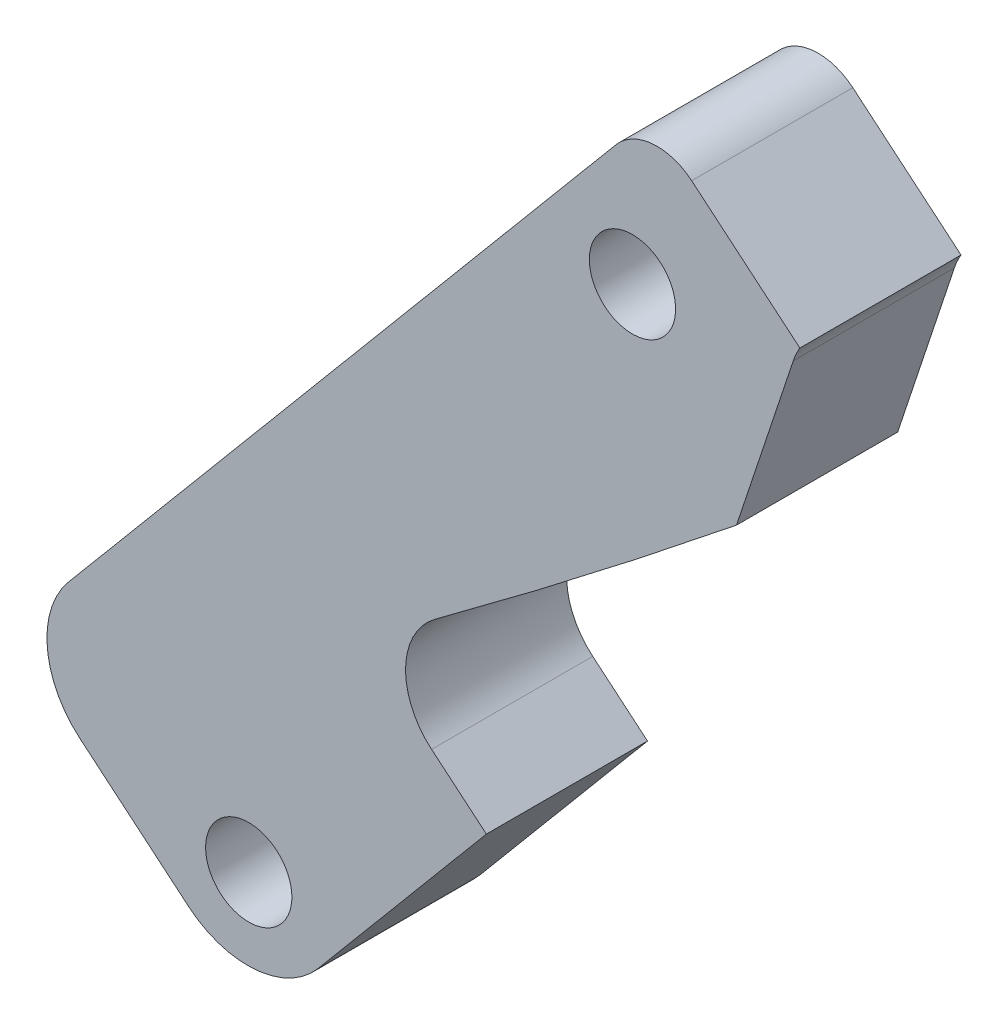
from build123d import *

# Parameters (mm, degrees)
BOSS_EXTRUDE1_DEPTH = 13.335
CUT_EXTRUDE1_DEPTH  = 540.999642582
CUT_EXTRUDE2_DEPTH  = 540.999642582
HOLE1_D             = 7.1374
HOLE1_CBORE_D       = 10.7188
HOLE1_CBORE_DEPTH   = 7.874


with BuildPart() as part:
    # Sketch1 → Boss-Extrude1 (new body)
    with BuildSketch(Plane(origin=(0, 0, 3.2), x_dir=(-1, 0, 0), z_dir=(0, 0, -1))):
        with BuildLine():
            Line((519.55464783, -93.9664528), (528.553754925, -86.415305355))
            ThreePointArc((528.553754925, -86.415305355), (531.246716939, -81.242173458), (529.492971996, -75.680005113))
            Line((529.492971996, -75.680005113), (484.186087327, -21.68536254))
            ThreePointArc((484.186087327, -21.68536254), (481.168427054, -20.114468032), (477.923828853, -21.137485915))
            Line((477.923828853, -21.137485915), (464.060339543, -32.770334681))
            ThreePointArc((464.060339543, -32.770334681), (462.489445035, -35.787994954), (463.512462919, -39.032593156))
            Line((463.512462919, -39.032593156), (508.819347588, -93.027235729))
            ThreePointArc((508.819347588, -93.027235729), (513.992479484, -95.720197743), (519.55464783, -93.9664528))
        make_face()
    extrude(amount=-BOSS_EXTRUDE1_DEPTH)

    # Sketch2 → Cut-Extrude1 (cut, through all)
    with BuildSketch(Plane(origin=(0, 0, 3.2), x_dir=(-1, 0, 0), z_dir=(0, 0, -1))):
        with BuildLine():
            Line((474.213638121, -43.964838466), (469.519631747, -29.846744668))
            ThreePointArc((469.519631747, -29.846744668), (461.8919834, -26.025606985), (458.070845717, -33.653255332))
            Line((458.070845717, -33.653255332), (462.764852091, -47.77134913))
            ThreePointArc((462.764852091, -47.77134913), (464.300010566, -50.841190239), (466.637487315, -53.354522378))
            ThreePointArc((466.637487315, -53.354522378), (479.206681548, -63.264526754), (491.995833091, -72.888997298))
            ThreePointArc((491.995833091, -72.888997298), (500.429323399, -71.60122646), (499.141552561, -63.167736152))
            ThreePointArc((499.141552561, -63.167736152), (486.569483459, -53.706630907), (474.213638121, -43.964838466))
        make_face()
    extrude(amount=-CUT_EXTRUDE1_DEPTH, mode=Mode.SUBTRACT)

    # Sketch3 → Cut-Extrude2 (cut, through all)
    with BuildSketch(Plane.XY.offset(16.535)):
        with BuildLine():
            Line((-491.801379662, -72.746011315), (-494.912572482, -76.453786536))
            Line((-494.912572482, -76.453786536), (-499.446309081, -72.649529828))
            ThreePointArc((-499.446309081, -72.649529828), (-495.762484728, -74.057753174), (-491.995833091, -72.888997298))
            ThreePointArc((-491.995833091, -72.888997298), (-491.898600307, -72.81751256), (-491.801379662, -72.746011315))
        make_face()
    extrude(amount=-CUT_EXTRUDE2_DEPTH, mode=Mode.SUBTRACT)

    # Hole1 (through all)
    with Locations(Plane(origin=(-469.952688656, -30.073592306, 3.2), x_dir=(-1, 0, 0), z_dir=(0, 0, -1))):
        with Locations((12.869107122, -0.934999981), (44.625649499, -58.950210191)):
            CounterBoreHole(HOLE1_D / 2, HOLE1_CBORE_D / 2, HOLE1_CBORE_DEPTH)


solid = part.part
